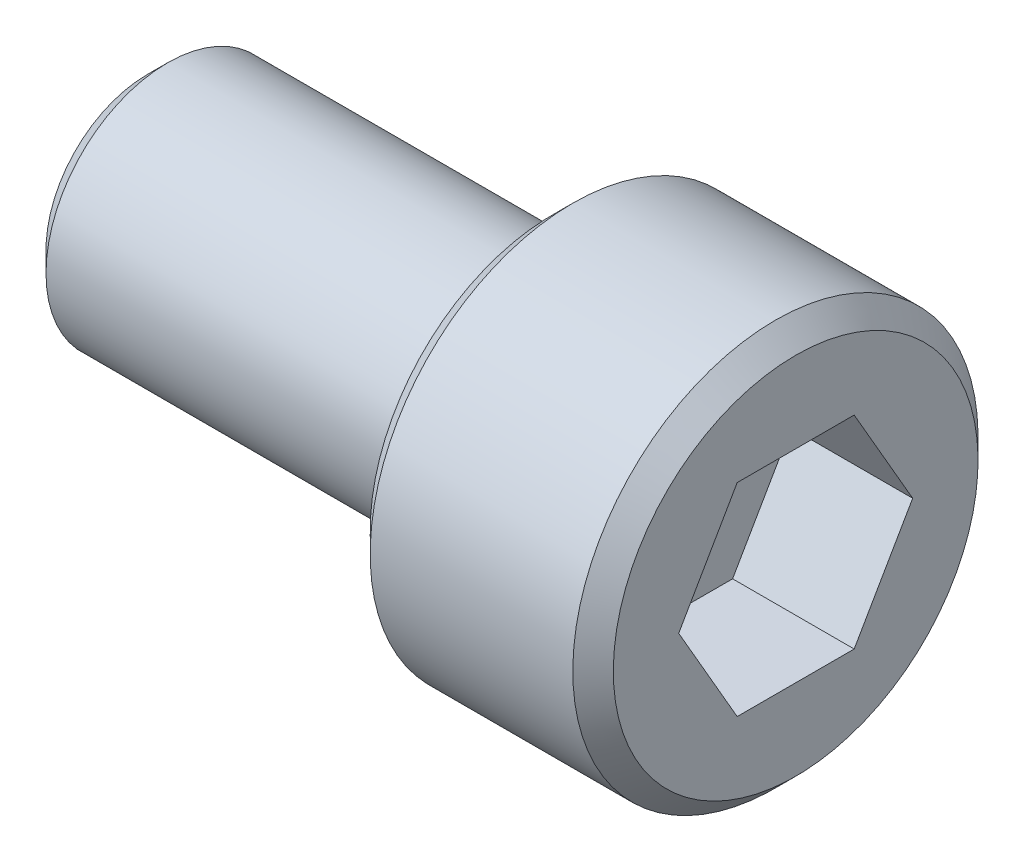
ISO-10303-21;
HEADER;
FILE_DESCRIPTION(('STEP AP214'),'2;1');
FILE_NAME('part.step','',(''),(''),'','','');
FILE_SCHEMA(('AUTOMOTIVE_DESIGN { 1 0 10303 214 1 1 1 1 }'));
ENDSEC;
DATA;
#1=APPLICATION_CONTEXT('core data for automotive mechanical design processes');
#2=APPLICATION_PROTOCOL_DEFINITION('international standard','automotive_design',2000,#1);
#3=PRODUCT_CONTEXT('',#1,'mechanical');
#4=PRODUCT('Part','Part','',(#3));
#5=PRODUCT_RELATED_PRODUCT_CATEGORY('part','',(#4));
#6=PRODUCT_DEFINITION_FORMATION('','',#4);
#7=PRODUCT_DEFINITION_CONTEXT('part definition',#1,'design');
#8=PRODUCT_DEFINITION('design','',#6,#7);
#9=PRODUCT_DEFINITION_SHAPE('','',#8);
#10=(LENGTH_UNIT() NAMED_UNIT(*) SI_UNIT(.MILLI.,.METRE.));
#11=(NAMED_UNIT(*) PLANE_ANGLE_UNIT() SI_UNIT($,.RADIAN.));
#12=(NAMED_UNIT(*) SI_UNIT($,.STERADIAN.) SOLID_ANGLE_UNIT());
#13=UNCERTAINTY_MEASURE_WITH_UNIT(LENGTH_MEASURE(1.E-05),#10,'distance_accuracy_value','');
#14=(GEOMETRIC_REPRESENTATION_CONTEXT(3) GLOBAL_UNCERTAINTY_ASSIGNED_CONTEXT((#13)) GLOBAL_UNIT_ASSIGNED_CONTEXT((#10,
#11,#12)) REPRESENTATION_CONTEXT('',''));
#15=CARTESIAN_POINT('',(0.,0.,0.));
#16=DIRECTION('',(0.,0.,1.));
#17=DIRECTION('',(1.,0.,0.));
#18=AXIS2_PLACEMENT_3D('',#15,#16,#17);
#19=CARTESIAN_POINT('',(-16.,0.,0.));
#20=DIRECTION('',(-1.,0.,0.));
#21=DIRECTION('',(0.,-1.,0.));
#22=AXIS2_PLACEMENT_3D('',#19,#20,#21);
#23=PLANE('',#22);
#24=CARTESIAN_POINT('',(-16.,0.,0.));
#25=DIRECTION('',(-1.,0.,0.));
#26=DIRECTION('',(0.,-1.,0.));
#27=AXIS2_PLACEMENT_3D('',#24,#25,#26);
#28=CIRCLE('',#27,2.49999999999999);
#29=CARTESIAN_POINT('',(-16.,-2.49999999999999,0.));
#30=VERTEX_POINT('',#29);
#31=EDGE_CURVE('E11',#30,#30,#28,.T.);
#32=ORIENTED_EDGE('',*,*,#31,.T.);
#33=EDGE_LOOP('',(#32));
#34=FACE_BOUND('',#33,.T.);
#35=ADVANCED_FACE('F43',(#34),#23,.T.);
#36=CARTESIAN_POINT('',(0.,0.,0.));
#37=DIRECTION('',(1.,0.,0.));
#38=DIRECTION('',(0.,1.,0.));
#39=AXIS2_PLACEMENT_3D('',#36,#37,#38);
#40=CYLINDRICAL_SURFACE('',#39,2.99999999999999);
#41=CARTESIAN_POINT('',(-15.5,0.,0.));
#42=DIRECTION('',(-1.,0.,0.));
#43=DIRECTION('',(0.,-1.,0.));
#44=AXIS2_PLACEMENT_3D('',#41,#42,#43);
#45=CIRCLE('',#44,2.99999999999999);
#46=CARTESIAN_POINT('',(-15.5,-2.99999999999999,0.));
#47=VERTEX_POINT('',#46);
#48=EDGE_CURVE('E53',#47,#47,#45,.F.);
#49=ORIENTED_EDGE('',*,*,#48,.T.);
#50=EDGE_LOOP('',(#49));
#51=FACE_BOUND('',#50,.T.);
#52=CARTESIAN_POINT('',(-6.,0.,0.));
#53=DIRECTION('',(1.,0.,0.));
#54=DIRECTION('',(0.,1.,0.));
#55=AXIS2_PLACEMENT_3D('',#52,#53,#54);
#56=CIRCLE('',#55,2.99999999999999);
#57=CARTESIAN_POINT('',(-6.,2.99999999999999,0.));
#58=VERTEX_POINT('',#57);
#59=EDGE_CURVE('E159',#58,#58,#56,.T.);
#60=ORIENTED_EDGE('',*,*,#59,.F.);
#61=EDGE_LOOP('',(#60));
#62=FACE_BOUND('',#61,.T.);
#63=ADVANCED_FACE('F191',(#51,#62),#40,.T.);
#64=CARTESIAN_POINT('',(-6.,2.99999999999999,0.));
#65=DIRECTION('',(-1.,0.,0.));
#66=DIRECTION('',(0.,-1.,0.));
#67=AXIS2_PLACEMENT_3D('',#64,#65,#66);
#68=PLANE('',#67);
#69=CARTESIAN_POINT('',(-6.,0.,0.));
#70=DIRECTION('',(-1.,0.,0.));
#71=DIRECTION('',(0.,-1.,0.));
#72=AXIS2_PLACEMENT_3D('',#69,#70,#71);
#73=CIRCLE('',#72,4.5);
#74=CARTESIAN_POINT('',(-6.,-4.5,0.));
#75=VERTEX_POINT('',#74);
#76=EDGE_CURVE('E184',#75,#75,#73,.T.);
#77=ORIENTED_EDGE('',*,*,#76,.T.);
#78=EDGE_LOOP('',(#77));
#79=FACE_BOUND('',#78,.T.);
#80=ORIENTED_EDGE('',*,*,#59,.T.);
#81=EDGE_LOOP('',(#80));
#82=FACE_BOUND('',#81,.T.);
#83=ADVANCED_FACE('F209',(#79,#82),#68,.T.);
#84=CARTESIAN_POINT('',(0.,0.,0.));
#85=DIRECTION('',(1.,0.,0.));
#86=DIRECTION('',(0.,1.,0.));
#87=AXIS2_PLACEMENT_3D('',#84,#85,#86);
#88=CYLINDRICAL_SURFACE('',#87,5.);
#89=CARTESIAN_POINT('',(-0.499999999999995,0.,0.));
#90=DIRECTION('',(1.,0.,0.));
#91=DIRECTION('',(0.,1.,0.));
#92=AXIS2_PLACEMENT_3D('',#89,#90,#91);
#93=CIRCLE('',#92,5.);
#94=CARTESIAN_POINT('',(-0.499999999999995,5.,0.));
#95=VERTEX_POINT('',#94);
#96=EDGE_CURVE('E180',#95,#95,#93,.F.);
#97=ORIENTED_EDGE('',*,*,#96,.T.);
#98=EDGE_LOOP('',(#97));
#99=FACE_BOUND('',#98,.T.);
#100=CARTESIAN_POINT('',(-5.5,0.,0.));
#101=DIRECTION('',(-1.,0.,0.));
#102=DIRECTION('',(0.,-1.,0.));
#103=AXIS2_PLACEMENT_3D('',#100,#101,#102);
#104=CIRCLE('',#103,5.);
#105=CARTESIAN_POINT('',(-5.5,-5.,0.));
#106=VERTEX_POINT('',#105);
#107=EDGE_CURVE('E176',#106,#106,#104,.F.);
#108=ORIENTED_EDGE('',*,*,#107,.T.);
#109=EDGE_LOOP('',(#108));
#110=FACE_BOUND('',#109,.T.);
#111=ADVANCED_FACE('F236',(#99,#110),#88,.T.);
#112=CARTESIAN_POINT('',(0.,5.,0.));
#113=DIRECTION('',(1.,0.,0.));
#114=DIRECTION('',(0.,1.,0.));
#115=AXIS2_PLACEMENT_3D('',#112,#113,#114);
#116=PLANE('',#115);
#117=CARTESIAN_POINT('',(0.,0.,0.));
#118=DIRECTION('',(1.,0.,0.));
#119=DIRECTION('',(0.,1.,0.));
#120=AXIS2_PLACEMENT_3D('',#117,#118,#119);
#121=CIRCLE('',#120,4.50000000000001);
#122=CARTESIAN_POINT('',(0.,4.50000000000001,0.));
#123=VERTEX_POINT('',#122);
#124=EDGE_CURVE('E172',#123,#123,#121,.T.);
#125=ORIENTED_EDGE('',*,*,#124,.T.);
#126=EDGE_LOOP('',(#125));
#127=FACE_BOUND('',#126,.T.);
#128=DIRECTION('',(0.,0.866025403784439,-0.5));
#129=VECTOR('',#128,1.);
#130=CARTESIAN_POINT('',(0.,-2.5,-1.44337567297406));
#131=LINE('',#130,#129);
#132=CARTESIAN_POINT('',(0.,-2.5,-1.44337567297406));
#133=VERTEX_POINT('',#132);
#134=CARTESIAN_POINT('',(0.,0.,-2.88675134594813));
#135=VERTEX_POINT('',#134);
#136=EDGE_CURVE('E60',#133,#135,#131,.T.);
#137=ORIENTED_EDGE('',*,*,#136,.F.);
#138=DIRECTION('',(0.,0.,-1.));
#139=VECTOR('',#138,1.);
#140=CARTESIAN_POINT('',(0.,-2.5,1.44337567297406));
#141=LINE('',#140,#139);
#142=CARTESIAN_POINT('',(0.,-2.5,1.44337567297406));
#143=VERTEX_POINT('',#142);
#144=EDGE_CURVE('E153',#143,#133,#141,.T.);
#145=ORIENTED_EDGE('',*,*,#144,.F.);
#146=DIRECTION('',(0.,-0.866025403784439,-0.5));
#147=VECTOR('',#146,1.);
#148=CARTESIAN_POINT('',(0.,0.,2.88675134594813));
#149=LINE('',#148,#147);
#150=CARTESIAN_POINT('',(0.,0.,2.88675134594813));
#151=VERTEX_POINT('',#150);
#152=EDGE_CURVE('E150',#151,#143,#149,.T.);
#153=ORIENTED_EDGE('',*,*,#152,.F.);
#154=DIRECTION('',(0.,-0.866025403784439,0.5));
#155=VECTOR('',#154,1.);
#156=CARTESIAN_POINT('',(0.,2.5,1.44337567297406));
#157=LINE('',#156,#155);
#158=CARTESIAN_POINT('',(0.,2.5,1.44337567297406));
#159=VERTEX_POINT('',#158);
#160=EDGE_CURVE('E108',#159,#151,#157,.T.);
#161=ORIENTED_EDGE('',*,*,#160,.F.);
#162=DIRECTION('',(0.,0.,1.));
#163=VECTOR('',#162,1.);
#164=CARTESIAN_POINT('',(0.,2.5,-1.44337567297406));
#165=LINE('',#164,#163);
#166=CARTESIAN_POINT('',(0.,2.5,-1.44337567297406));
#167=VERTEX_POINT('',#166);
#168=EDGE_CURVE('E144',#167,#159,#165,.T.);
#169=ORIENTED_EDGE('',*,*,#168,.F.);
#170=DIRECTION('',(0.,0.866025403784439,0.5));
#171=VECTOR('',#170,1.);
#172=CARTESIAN_POINT('',(0.,0.,-2.88675134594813));
#173=LINE('',#172,#171);
#174=EDGE_CURVE('E140',#135,#167,#173,.T.);
#175=ORIENTED_EDGE('',*,*,#174,.F.);
#176=EDGE_LOOP('',(#137,#145,#153,#161,#169,#175));
#177=FACE_BOUND('',#176,.T.);
#178=ADVANCED_FACE('F232',(#127,#177),#116,.T.);
#179=CARTESIAN_POINT('',(-3.,-2.5,-1.44337567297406));
#180=DIRECTION('',(0.,-0.5,-0.866025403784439));
#181=DIRECTION('',(0.,0.866025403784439,-0.5));
#182=AXIS2_PLACEMENT_3D('',#179,#180,#181);
#183=PLANE('',#182);
#184=ORIENTED_EDGE('',*,*,#136,.T.);
#185=DIRECTION('',(1.,0.,0.));
#186=VECTOR('',#185,1.);
#187=CARTESIAN_POINT('',(-3.,0.,-2.88675134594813));
#188=LINE('',#187,#186);
#189=CARTESIAN_POINT('',(-3.,0.,-2.88675134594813));
#190=VERTEX_POINT('',#189);
#191=EDGE_CURVE('E90',#190,#135,#188,.T.);
#192=ORIENTED_EDGE('',*,*,#191,.F.);
#193=DIRECTION('',(0.,0.866025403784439,-0.5));
#194=VECTOR('',#193,1.);
#195=CARTESIAN_POINT('',(-3.,-2.5,-1.44337567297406));
#196=LINE('',#195,#194);
#197=CARTESIAN_POINT('',(-3.,-2.5,-1.44337567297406));
#198=VERTEX_POINT('',#197);
#199=EDGE_CURVE('E156',#198,#190,#196,.T.);
#200=ORIENTED_EDGE('',*,*,#199,.F.);
#201=DIRECTION('',(1.,0.,0.));
#202=VECTOR('',#201,1.);
#203=CARTESIAN_POINT('',(-3.,-2.5,-1.44337567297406));
#204=LINE('',#203,#202);
#205=EDGE_CURVE('E68',#198,#133,#204,.T.);
#206=ORIENTED_EDGE('',*,*,#205,.T.);
#207=EDGE_LOOP('',(#184,#192,#200,#206));
#208=FACE_BOUND('',#207,.T.);
#209=ADVANCED_FACE('F235',(#208),#183,.F.);
#210=CARTESIAN_POINT('',(-3.,-2.5,1.44337567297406));
#211=DIRECTION('',(0.,-1.,0.));
#212=DIRECTION('',(1.,0.,0.));
#213=AXIS2_PLACEMENT_3D('',#210,#211,#212);
#214=PLANE('',#213);
#215=ORIENTED_EDGE('',*,*,#144,.T.);
#216=ORIENTED_EDGE('',*,*,#205,.F.);
#217=DIRECTION('',(0.,0.,-1.));
#218=VECTOR('',#217,1.);
#219=CARTESIAN_POINT('',(-3.,-2.5,1.44337567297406));
#220=LINE('',#219,#218);
#221=CARTESIAN_POINT('',(-3.,-2.5,1.44337567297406));
#222=VERTEX_POINT('',#221);
#223=EDGE_CURVE('E122',#222,#198,#220,.T.);
#224=ORIENTED_EDGE('',*,*,#223,.F.);
#225=DIRECTION('',(1.,0.,0.));
#226=VECTOR('',#225,1.);
#227=CARTESIAN_POINT('',(-3.,-2.5,1.44337567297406));
#228=LINE('',#227,#226);
#229=EDGE_CURVE('E113',#222,#143,#228,.T.);
#230=ORIENTED_EDGE('',*,*,#229,.T.);
#231=EDGE_LOOP('',(#215,#216,#224,#230));
#232=FACE_BOUND('',#231,.T.);
#233=ADVANCED_FACE('F246',(#232),#214,.F.);
#234=CARTESIAN_POINT('',(-3.,0.,2.88675134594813));
#235=DIRECTION('',(0.,-0.5,0.866025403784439));
#236=DIRECTION('',(0.,-0.866025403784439,-0.5));
#237=AXIS2_PLACEMENT_3D('',#234,#235,#236);
#238=PLANE('',#237);
#239=ORIENTED_EDGE('',*,*,#152,.T.);
#240=ORIENTED_EDGE('',*,*,#229,.F.);
#241=DIRECTION('',(0.,-0.866025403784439,-0.5));
#242=VECTOR('',#241,1.);
#243=CARTESIAN_POINT('',(-3.,0.,2.88675134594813));
#244=LINE('',#243,#242);
#245=CARTESIAN_POINT('',(-3.,0.,2.88675134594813));
#246=VERTEX_POINT('',#245);
#247=EDGE_CURVE('E117',#246,#222,#244,.T.);
#248=ORIENTED_EDGE('',*,*,#247,.F.);
#249=DIRECTION('',(1.,0.,0.));
#250=VECTOR('',#249,1.);
#251=CARTESIAN_POINT('',(-3.,0.,2.88675134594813));
#252=LINE('',#251,#250);
#253=EDGE_CURVE('E101',#246,#151,#252,.T.);
#254=ORIENTED_EDGE('',*,*,#253,.T.);
#255=EDGE_LOOP('',(#239,#240,#248,#254));
#256=FACE_BOUND('',#255,.T.);
#257=ADVANCED_FACE('F118',(#256),#238,.F.);
#258=CARTESIAN_POINT('',(-3.,2.5,1.44337567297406));
#259=DIRECTION('',(0.,0.5,0.866025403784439));
#260=DIRECTION('',(0.,-0.866025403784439,0.5));
#261=AXIS2_PLACEMENT_3D('',#258,#259,#260);
#262=PLANE('',#261);
#263=ORIENTED_EDGE('',*,*,#160,.T.);
#264=ORIENTED_EDGE('',*,*,#253,.F.);
#265=DIRECTION('',(0.,-0.866025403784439,0.5));
#266=VECTOR('',#265,1.);
#267=CARTESIAN_POINT('',(-3.,2.5,1.44337567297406));
#268=LINE('',#267,#266);
#269=CARTESIAN_POINT('',(-3.,2.5,1.44337567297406));
#270=VERTEX_POINT('',#269);
#271=EDGE_CURVE('E105',#270,#246,#268,.T.);
#272=ORIENTED_EDGE('',*,*,#271,.F.);
#273=DIRECTION('',(1.,0.,0.));
#274=VECTOR('',#273,1.);
#275=CARTESIAN_POINT('',(-3.,2.5,1.44337567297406));
#276=LINE('',#275,#274);
#277=EDGE_CURVE('E114',#270,#159,#276,.T.);
#278=ORIENTED_EDGE('',*,*,#277,.T.);
#279=EDGE_LOOP('',(#263,#264,#272,#278));
#280=FACE_BOUND('',#279,.T.);
#281=ADVANCED_FACE('F103',(#280),#262,.F.);
#282=CARTESIAN_POINT('',(-3.,2.5,-1.44337567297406));
#283=DIRECTION('',(0.,1.,0.));
#284=DIRECTION('',(-1.,0.,0.));
#285=AXIS2_PLACEMENT_3D('',#282,#283,#284);
#286=PLANE('',#285);
#287=ORIENTED_EDGE('',*,*,#168,.T.);
#288=ORIENTED_EDGE('',*,*,#277,.F.);
#289=DIRECTION('',(0.,0.,1.));
#290=VECTOR('',#289,1.);
#291=CARTESIAN_POINT('',(-3.,2.5,-1.44337567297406));
#292=LINE('',#291,#290);
#293=CARTESIAN_POINT('',(-3.,2.5,-1.44337567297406));
#294=VERTEX_POINT('',#293);
#295=EDGE_CURVE('E128',#294,#270,#292,.T.);
#296=ORIENTED_EDGE('',*,*,#295,.F.);
#297=DIRECTION('',(1.,0.,0.));
#298=VECTOR('',#297,1.);
#299=CARTESIAN_POINT('',(-3.,2.5,-1.44337567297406));
#300=LINE('',#299,#298);
#301=EDGE_CURVE('E164',#294,#167,#300,.T.);
#302=ORIENTED_EDGE('',*,*,#301,.T.);
#303=EDGE_LOOP('',(#287,#288,#296,#302));
#304=FACE_BOUND('',#303,.T.);
#305=ADVANCED_FACE('F308',(#304),#286,.F.);
#306=CARTESIAN_POINT('',(-3.,0.,-2.88675134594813));
#307=DIRECTION('',(0.,0.5,-0.866025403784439));
#308=DIRECTION('',(0.,0.866025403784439,0.5));
#309=AXIS2_PLACEMENT_3D('',#306,#307,#308);
#310=PLANE('',#309);
#311=ORIENTED_EDGE('',*,*,#174,.T.);
#312=ORIENTED_EDGE('',*,*,#301,.F.);
#313=DIRECTION('',(0.,0.866025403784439,0.5));
#314=VECTOR('',#313,1.);
#315=CARTESIAN_POINT('',(-3.,0.,-2.88675134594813));
#316=LINE('',#315,#314);
#317=EDGE_CURVE('E132',#190,#294,#316,.T.);
#318=ORIENTED_EDGE('',*,*,#317,.F.);
#319=ORIENTED_EDGE('',*,*,#191,.T.);
#320=EDGE_LOOP('',(#311,#312,#318,#319));
#321=FACE_BOUND('',#320,.T.);
#322=ADVANCED_FACE('F226',(#321),#310,.F.);
#323=CARTESIAN_POINT('',(-3.,0.,0.));
#324=DIRECTION('',(1.,0.,0.));
#325=DIRECTION('',(0.,1.,0.));
#326=AXIS2_PLACEMENT_3D('',#323,#324,#325);
#327=PLANE('',#326);
#328=ORIENTED_EDGE('',*,*,#199,.T.);
#329=ORIENTED_EDGE('',*,*,#317,.T.);
#330=ORIENTED_EDGE('',*,*,#295,.T.);
#331=ORIENTED_EDGE('',*,*,#271,.T.);
#332=ORIENTED_EDGE('',*,*,#247,.T.);
#333=ORIENTED_EDGE('',*,*,#223,.T.);
#334=EDGE_LOOP('',(#328,#329,#330,#331,#332,#333));
#335=FACE_BOUND('',#334,.T.);
#336=ADVANCED_FACE('F125',(#335),#327,.T.);
#337=CARTESIAN_POINT('',(0.,0.,0.));
#338=DIRECTION('',(-1.,0.,0.));
#339=DIRECTION('',(0.,-1.,0.));
#340=AXIS2_PLACEMENT_3D('',#337,#338,#339);
#341=CONICAL_SURFACE('',#340,4.50000000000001,0.785398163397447);
#342=ORIENTED_EDGE('',*,*,#96,.F.);
#343=EDGE_LOOP('',(#342));
#344=FACE_BOUND('',#343,.T.);
#345=ORIENTED_EDGE('',*,*,#124,.F.);
#346=EDGE_LOOP('',(#345));
#347=FACE_BOUND('',#346,.T.);
#348=ADVANCED_FACE('F200',(#344,#347),#341,.T.);
#349=CARTESIAN_POINT('',(-5.5,0.,0.));
#350=DIRECTION('',(1.,0.,0.));
#351=DIRECTION('',(0.,1.,0.));
#352=AXIS2_PLACEMENT_3D('',#349,#350,#351);
#353=CONICAL_SURFACE('',#352,5.,0.78539816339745);
#354=ORIENTED_EDGE('',*,*,#76,.F.);
#355=EDGE_LOOP('',(#354));
#356=FACE_BOUND('',#355,.T.);
#357=ORIENTED_EDGE('',*,*,#107,.F.);
#358=EDGE_LOOP('',(#357));
#359=FACE_BOUND('',#358,.T.);
#360=ADVANCED_FACE('F195',(#356,#359),#353,.T.);
#361=CARTESIAN_POINT('',(-15.5,0.,0.));
#362=DIRECTION('',(1.,0.,0.));
#363=DIRECTION('',(0.,1.,0.));
#364=AXIS2_PLACEMENT_3D('',#361,#362,#363);
#365=CONICAL_SURFACE('',#364,2.99999999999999,0.785398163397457);
#366=ORIENTED_EDGE('',*,*,#31,.F.);
#367=EDGE_LOOP('',(#366));
#368=FACE_BOUND('',#367,.T.);
#369=ORIENTED_EDGE('',*,*,#48,.F.);
#370=EDGE_LOOP('',(#369));
#371=FACE_BOUND('',#370,.T.);
#372=ADVANCED_FACE('F46',(#368,#371),#365,.T.);
#373=CLOSED_SHELL('',(#35,#63,#83,#111,#178,#209,#233,#257,#281,#305,#322,#336,#348,#360,#372));
#374=MANIFOLD_SOLID_BREP('B2',#373);
#375=ADVANCED_BREP_SHAPE_REPRESENTATION('',(#18,#374),#14);
#376=SHAPE_DEFINITION_REPRESENTATION(#9,#375);
ENDSEC;
END-ISO-10303-21;
